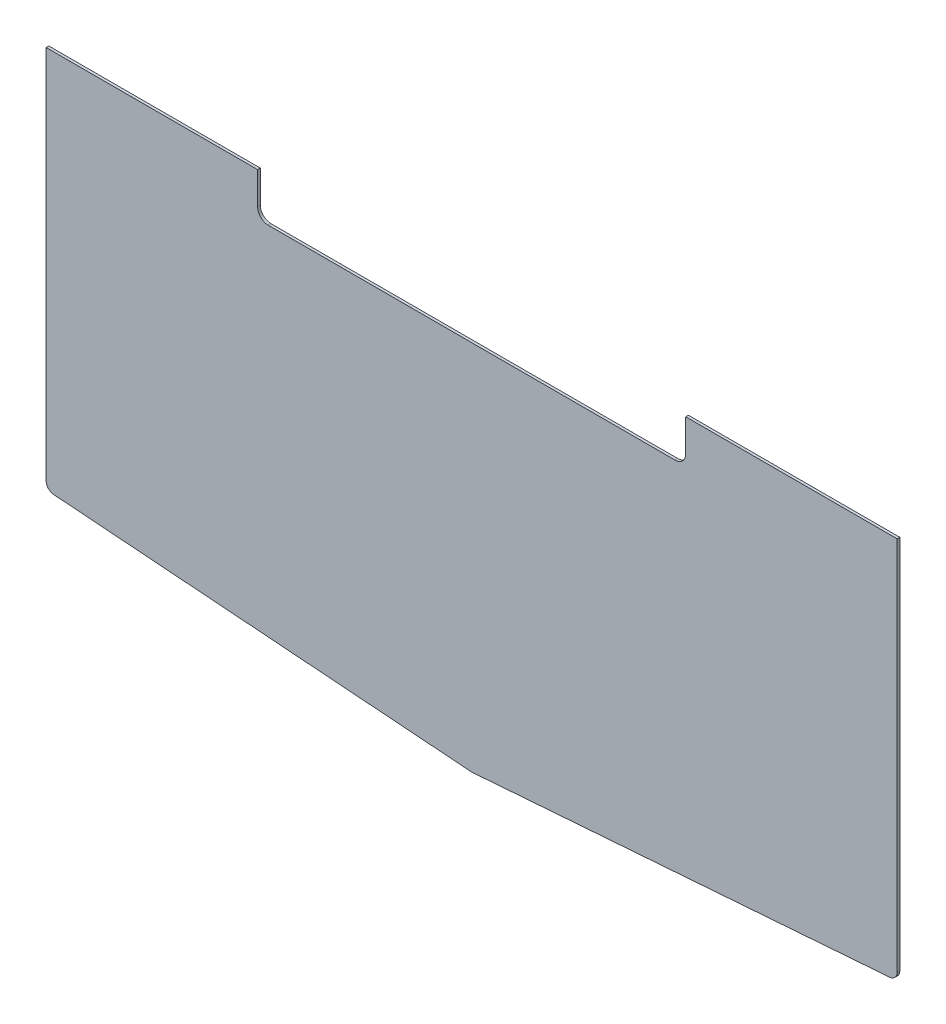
from build123d import *

# Parameters (mm, degrees)
EXTRUDE1_DEPTH     = 1.5875
SKETCH2_W          = 254
SKETCH2_H          = 25.4
CUT_EXTRUDE1_DEPTH = 416.627995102
FILLET1_R          = 6.35


with BuildPart() as part:
    # Sketch1 → Extrude1 (new body)
    with BuildSketch(Plane.XY):
        with BuildLine():
            Line((-252.4125, 107.491584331), (-252.4125, 330.2))
            Line((-252.4125, 330.2), (252.4125, 330.2))
            Line((252.4125, 330.2), (252.4125, 107.491584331))
            ThreePointArc((252.4125, 107.491584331), (251.141256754, 104.252366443), (248.006187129, 102.742422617))
            Line((248.006187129, 102.742422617), (0.356187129, 84.168672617))
            ThreePointArc((0.356187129, 84.168672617), (0, 84.155334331), (-0.356187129, 84.168672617))
            Line((-0.356187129, 84.168672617), (-248.006187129, 102.742422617))
            ThreePointArc((-248.006187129, 102.742422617), (-251.141256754, 104.252366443), (-252.4125, 107.491584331))
        make_face()
    extrude(amount=EXTRUDE1_DEPTH)

    # Sketch2 → Cut-Extrude1 (cut, through all)
    with BuildSketch(Plane.XY.offset(1.5875)):
        with Locations((0, 317.5)):
            Rectangle(SKETCH2_W, SKETCH2_H)
    extrude(amount=-CUT_EXTRUDE1_DEPTH, mode=Mode.SUBTRACT)

    # Fillet1
    fillet1_edges = [part.edges().sort_by_distance(p)[0] for p in [
        (-127, 304.8, 0.79375),
        (127, 304.8, 0.79375),
    ]]
    fillet(fillet1_edges, radius=FILLET1_R)


solid = part.part
